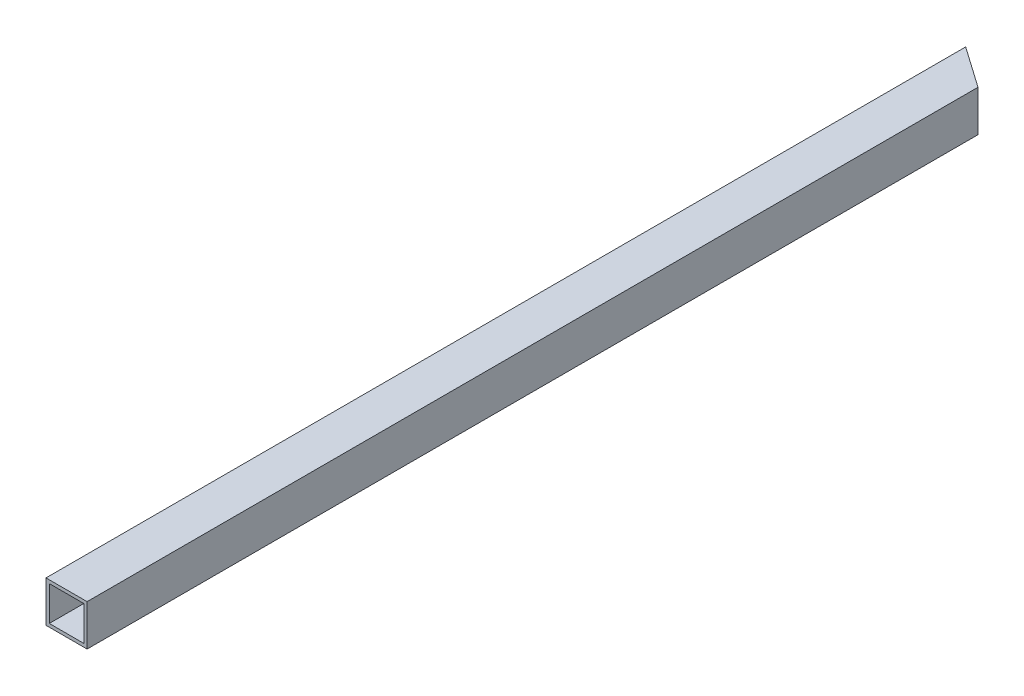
ISO-10303-21;
HEADER;
FILE_DESCRIPTION(('STEP AP214'),'2;1');
FILE_NAME('part.step','',(''),(''),'','','');
FILE_SCHEMA(('AUTOMOTIVE_DESIGN { 1 0 10303 214 1 1 1 1 }'));
ENDSEC;
DATA;
#1=APPLICATION_CONTEXT('core data for automotive mechanical design processes');
#2=APPLICATION_PROTOCOL_DEFINITION('international standard','automotive_design',2000,#1);
#3=PRODUCT_CONTEXT('',#1,'mechanical');
#4=PRODUCT('Part','Part','',(#3));
#5=PRODUCT_RELATED_PRODUCT_CATEGORY('part','',(#4));
#6=PRODUCT_DEFINITION_FORMATION('','',#4);
#7=PRODUCT_DEFINITION_CONTEXT('part definition',#1,'design');
#8=PRODUCT_DEFINITION('design','',#6,#7);
#9=PRODUCT_DEFINITION_SHAPE('','',#8);
#10=(LENGTH_UNIT() NAMED_UNIT(*) SI_UNIT(.MILLI.,.METRE.));
#11=(NAMED_UNIT(*) PLANE_ANGLE_UNIT() SI_UNIT($,.RADIAN.));
#12=(NAMED_UNIT(*) SI_UNIT($,.STERADIAN.) SOLID_ANGLE_UNIT());
#13=UNCERTAINTY_MEASURE_WITH_UNIT(LENGTH_MEASURE(1.E-05),#10,'distance_accuracy_value','');
#14=(GEOMETRIC_REPRESENTATION_CONTEXT(3) GLOBAL_UNCERTAINTY_ASSIGNED_CONTEXT((#13)) GLOBAL_UNIT_ASSIGNED_CONTEXT((#10,
#11,#12)) REPRESENTATION_CONTEXT('',''));
#15=CARTESIAN_POINT('',(0.,0.,0.));
#16=DIRECTION('',(0.,0.,1.));
#17=DIRECTION('',(1.,0.,0.));
#18=AXIS2_PLACEMENT_3D('',#15,#16,#17);
#19=CARTESIAN_POINT('',(-21.,21.,-25.));
#20=DIRECTION('',(1.,0.,0.));
#21=DIRECTION('',(0.,1.,0.));
#22=AXIS2_PLACEMENT_3D('',#19,#20,#21);
#23=PLANE('',#22);
#24=DIRECTION('',(0.,-1.,0.));
#25=VECTOR('',#24,1.);
#26=CARTESIAN_POINT('',(-21.,10.5,-14.7));
#27=LINE('',#26,#25);
#28=CARTESIAN_POINT('',(-21.,21.,-14.7));
#29=VERTEX_POINT('',#28);
#30=CARTESIAN_POINT('',(-21.,-21.,-14.7));
#31=VERTEX_POINT('',#30);
#32=EDGE_CURVE('E88',#29,#31,#27,.T.);
#33=ORIENTED_EDGE('',*,*,#32,.F.);
#34=DIRECTION('',(0.,0.,1.));
#35=VECTOR('',#34,1.);
#36=CARTESIAN_POINT('',(-21.,21.,-25.));
#37=LINE('',#36,#35);
#38=CARTESIAN_POINT('',(-21.,21.,1101.26844483));
#39=VERTEX_POINT('',#38);
#40=EDGE_CURVE('E10',#29,#39,#37,.T.);
#41=ORIENTED_EDGE('',*,*,#40,.T.);
#42=DIRECTION('',(0.,1.,0.));
#43=VECTOR('',#42,1.);
#44=CARTESIAN_POINT('',(-21.,10.5,1101.26844483));
#45=LINE('',#44,#43);
#46=CARTESIAN_POINT('',(-21.,-21.,1101.26844483));
#47=VERTEX_POINT('',#46);
#48=EDGE_CURVE('E143',#47,#39,#45,.T.);
#49=ORIENTED_EDGE('',*,*,#48,.F.);
#50=DIRECTION('',(0.,0.,1.));
#51=VECTOR('',#50,1.);
#52=CARTESIAN_POINT('',(-21.,-21.,-25.));
#53=LINE('',#52,#51);
#54=EDGE_CURVE('E163',#31,#47,#53,.T.);
#55=ORIENTED_EDGE('',*,*,#54,.F.);
#56=EDGE_LOOP('',(#33,#41,#49,#55));
#57=FACE_BOUND('',#56,.T.);
#58=ADVANCED_FACE('F16',(#57),#23,.T.);
#59=CARTESIAN_POINT('',(21.,21.,-25.));
#60=DIRECTION('',(0.,-1.,0.));
#61=DIRECTION('',(0.,0.,-1.));
#62=AXIS2_PLACEMENT_3D('',#59,#60,#61);
#63=PLANE('',#62);
#64=DIRECTION('',(-0.819231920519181,0.,-0.573462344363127));
#65=VECTOR('',#64,1.);
#66=CARTESIAN_POINT('',(1.174496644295,21.,0.822147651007));
#67=LINE('',#66,#65);
#68=CARTESIAN_POINT('',(21.,21.,14.7));
#69=VERTEX_POINT('',#68);
#70=EDGE_CURVE('E83',#69,#29,#67,.T.);
#71=ORIENTED_EDGE('',*,*,#70,.F.);
#72=DIRECTION('',(0.,0.,1.));
#73=VECTOR('',#72,1.);
#74=CARTESIAN_POINT('',(21.,21.,-25.));
#75=LINE('',#74,#73);
#76=CARTESIAN_POINT('',(21.,21.,1101.26844483));
#77=VERTEX_POINT('',#76);
#78=EDGE_CURVE('E26',#69,#77,#75,.T.);
#79=ORIENTED_EDGE('',*,*,#78,.T.);
#80=DIRECTION('',(1.,0.,0.));
#81=VECTOR('',#80,1.);
#82=CARTESIAN_POINT('',(10.5,21.,1101.26844483));
#83=LINE('',#82,#81);
#84=EDGE_CURVE('E150',#39,#77,#83,.T.);
#85=ORIENTED_EDGE('',*,*,#84,.F.);
#86=ORIENTED_EDGE('',*,*,#40,.F.);
#87=EDGE_LOOP('',(#71,#79,#85,#86));
#88=FACE_BOUND('',#87,.T.);
#89=ADVANCED_FACE('F18',(#88),#63,.T.);
#90=CARTESIAN_POINT('',(21.,-21.,-25.));
#91=DIRECTION('',(-1.,0.,0.));
#92=DIRECTION('',(0.,0.,1.));
#93=AXIS2_PLACEMENT_3D('',#90,#91,#92);
#94=PLANE('',#93);
#95=DIRECTION('',(0.,1.,0.));
#96=VECTOR('',#95,1.);
#97=CARTESIAN_POINT('',(21.,-10.5,14.7));
#98=LINE('',#97,#96);
#99=CARTESIAN_POINT('',(21.,-21.,14.7));
#100=VERTEX_POINT('',#99);
#101=EDGE_CURVE('E75',#100,#69,#98,.T.);
#102=ORIENTED_EDGE('',*,*,#101,.F.);
#103=DIRECTION('',(0.,0.,1.));
#104=VECTOR('',#103,1.);
#105=CARTESIAN_POINT('',(21.,-21.,-25.));
#106=LINE('',#105,#104);
#107=CARTESIAN_POINT('',(21.,-21.,1101.26844483));
#108=VERTEX_POINT('',#107);
#109=EDGE_CURVE('E39',#100,#108,#106,.T.);
#110=ORIENTED_EDGE('',*,*,#109,.T.);
#111=DIRECTION('',(0.,-1.,0.));
#112=VECTOR('',#111,1.);
#113=CARTESIAN_POINT('',(21.,-10.5,1101.26844483));
#114=LINE('',#113,#112);
#115=EDGE_CURVE('E77',#77,#108,#114,.T.);
#116=ORIENTED_EDGE('',*,*,#115,.F.);
#117=ORIENTED_EDGE('',*,*,#78,.F.);
#118=EDGE_LOOP('',(#102,#110,#116,#117));
#119=FACE_BOUND('',#118,.T.);
#120=ADVANCED_FACE('F73',(#119),#94,.T.);
#121=CARTESIAN_POINT('',(-21.,-21.,-25.));
#122=DIRECTION('',(0.,1.,0.));
#123=DIRECTION('',(1.,0.,0.));
#124=AXIS2_PLACEMENT_3D('',#121,#122,#123);
#125=PLANE('',#124);
#126=DIRECTION('',(0.819231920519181,0.,0.573462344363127));
#127=VECTOR('',#126,1.);
#128=CARTESIAN_POINT('',(-12.91946308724,-21.,-9.043624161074));
#129=LINE('',#128,#127);
#130=EDGE_CURVE('E94',#31,#100,#129,.T.);
#131=ORIENTED_EDGE('',*,*,#130,.F.);
#132=ORIENTED_EDGE('',*,*,#54,.T.);
#133=DIRECTION('',(-1.,0.,0.));
#134=VECTOR('',#133,1.);
#135=CARTESIAN_POINT('',(-10.5,-21.,1101.26844483));
#136=LINE('',#135,#134);
#137=EDGE_CURVE('E155',#108,#47,#136,.T.);
#138=ORIENTED_EDGE('',*,*,#137,.F.);
#139=ORIENTED_EDGE('',*,*,#109,.F.);
#140=EDGE_LOOP('',(#131,#132,#138,#139));
#141=FACE_BOUND('',#140,.T.);
#142=ADVANCED_FACE('F191',(#141),#125,.T.);
#143=CARTESIAN_POINT('',(25.,25.,-25.));
#144=DIRECTION('',(0.,-1.,0.));
#145=DIRECTION('',(0.,0.,-1.));
#146=AXIS2_PLACEMENT_3D('',#143,#144,#145);
#147=PLANE('',#146);
#148=DIRECTION('',(0.,0.,1.));
#149=VECTOR('',#148,1.);
#150=CARTESIAN_POINT('',(-25.,25.,-25.));
#151=LINE('',#150,#149);
#152=CARTESIAN_POINT('',(-25.,25.,-17.5));
#153=VERTEX_POINT('',#152);
#154=CARTESIAN_POINT('',(-25.,25.,1101.26844483));
#155=VERTEX_POINT('',#154);
#156=EDGE_CURVE('E159',#153,#155,#151,.T.);
#157=ORIENTED_EDGE('',*,*,#156,.T.);
#158=DIRECTION('',(1.,0.,0.));
#159=VECTOR('',#158,1.);
#160=CARTESIAN_POINT('',(12.5,25.,1101.26844483));
#161=LINE('',#160,#159);
#162=CARTESIAN_POINT('',(25.,25.,1101.26844483));
#163=VERTEX_POINT('',#162);
#164=EDGE_CURVE('E122',#155,#163,#161,.T.);
#165=ORIENTED_EDGE('',*,*,#164,.T.);
#166=DIRECTION('',(0.,0.,1.));
#167=VECTOR('',#166,1.);
#168=CARTESIAN_POINT('',(25.,25.,-25.));
#169=LINE('',#168,#167);
#170=CARTESIAN_POINT('',(25.,25.,17.5));
#171=VERTEX_POINT('',#170);
#172=EDGE_CURVE('E137',#171,#163,#169,.T.);
#173=ORIENTED_EDGE('',*,*,#172,.F.);
#174=DIRECTION('',(-0.819231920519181,0.,-0.573462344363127));
#175=VECTOR('',#174,1.);
#176=CARTESIAN_POINT('',(2.51677852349,25.,1.761744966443));
#177=LINE('',#176,#175);
#178=EDGE_CURVE('E121',#171,#153,#177,.T.);
#179=ORIENTED_EDGE('',*,*,#178,.T.);
#180=EDGE_LOOP('',(#157,#165,#173,#179));
#181=FACE_BOUND('',#180,.T.);
#182=ADVANCED_FACE('F185',(#181),#147,.F.);
#183=CARTESIAN_POINT('',(-25.,25.,-25.));
#184=DIRECTION('',(1.,0.,0.));
#185=DIRECTION('',(0.,1.,0.));
#186=AXIS2_PLACEMENT_3D('',#183,#184,#185);
#187=PLANE('',#186);
#188=DIRECTION('',(0.,0.,1.));
#189=VECTOR('',#188,1.);
#190=CARTESIAN_POINT('',(-25.,-25.,-25.));
#191=LINE('',#190,#189);
#192=CARTESIAN_POINT('',(-25.,-25.,-17.5));
#193=VERTEX_POINT('',#192);
#194=CARTESIAN_POINT('',(-25.,-25.,1101.26844483));
#195=VERTEX_POINT('',#194);
#196=EDGE_CURVE('E111',#193,#195,#191,.T.);
#197=ORIENTED_EDGE('',*,*,#196,.T.);
#198=DIRECTION('',(0.,1.,0.));
#199=VECTOR('',#198,1.);
#200=CARTESIAN_POINT('',(-25.,12.5,1101.26844483));
#201=LINE('',#200,#199);
#202=EDGE_CURVE('E126',#195,#155,#201,.T.);
#203=ORIENTED_EDGE('',*,*,#202,.T.);
#204=ORIENTED_EDGE('',*,*,#156,.F.);
#205=DIRECTION('',(0.,-1.,0.));
#206=VECTOR('',#205,1.);
#207=CARTESIAN_POINT('',(-25.,12.5,-17.5));
#208=LINE('',#207,#206);
#209=EDGE_CURVE('E96',#153,#193,#208,.T.);
#210=ORIENTED_EDGE('',*,*,#209,.T.);
#211=EDGE_LOOP('',(#197,#203,#204,#210));
#212=FACE_BOUND('',#211,.T.);
#213=ADVANCED_FACE('F190',(#212),#187,.F.);
#214=CARTESIAN_POINT('',(0.,0.,1101.26844483));
#215=DIRECTION('',(0.,0.,-1.));
#216=DIRECTION('',(0.,-1.,0.));
#217=AXIS2_PLACEMENT_3D('',#214,#215,#216);
#218=PLANE('',#217);
#219=ORIENTED_EDGE('',*,*,#48,.T.);
#220=ORIENTED_EDGE('',*,*,#84,.T.);
#221=ORIENTED_EDGE('',*,*,#115,.T.);
#222=ORIENTED_EDGE('',*,*,#137,.T.);
#223=EDGE_LOOP('',(#219,#220,#221,#222));
#224=FACE_BOUND('',#223,.T.);
#225=ORIENTED_EDGE('',*,*,#164,.F.);
#226=ORIENTED_EDGE('',*,*,#202,.F.);
#227=DIRECTION('',(-1.,0.,0.));
#228=VECTOR('',#227,1.);
#229=CARTESIAN_POINT('',(-12.5,-25.,1101.26844483));
#230=LINE('',#229,#228);
#231=CARTESIAN_POINT('',(25.,-25.,1101.26844483));
#232=VERTEX_POINT('',#231);
#233=EDGE_CURVE('E108',#232,#195,#230,.T.);
#234=ORIENTED_EDGE('',*,*,#233,.F.);
#235=DIRECTION('',(0.,-1.,0.));
#236=VECTOR('',#235,1.);
#237=CARTESIAN_POINT('',(25.,-12.5,1101.26844483));
#238=LINE('',#237,#236);
#239=EDGE_CURVE('E127',#163,#232,#238,.T.);
#240=ORIENTED_EDGE('',*,*,#239,.F.);
#241=EDGE_LOOP('',(#225,#226,#234,#240));
#242=FACE_BOUND('',#241,.T.);
#243=ADVANCED_FACE('F209',(#224,#242),#218,.F.);
#244=CARTESIAN_POINT('',(25.,-25.,-25.));
#245=DIRECTION('',(-1.,0.,0.));
#246=DIRECTION('',(0.,0.,1.));
#247=AXIS2_PLACEMENT_3D('',#244,#245,#246);
#248=PLANE('',#247);
#249=ORIENTED_EDGE('',*,*,#172,.T.);
#250=ORIENTED_EDGE('',*,*,#239,.T.);
#251=DIRECTION('',(0.,0.,1.));
#252=VECTOR('',#251,1.);
#253=CARTESIAN_POINT('',(25.,-25.,-25.));
#254=LINE('',#253,#252);
#255=CARTESIAN_POINT('',(25.,-25.,17.5));
#256=VERTEX_POINT('',#255);
#257=EDGE_CURVE('E107',#256,#232,#254,.T.);
#258=ORIENTED_EDGE('',*,*,#257,.F.);
#259=DIRECTION('',(0.,1.,0.));
#260=VECTOR('',#259,1.);
#261=CARTESIAN_POINT('',(25.,-12.5,17.5));
#262=LINE('',#261,#260);
#263=EDGE_CURVE('E103',#256,#171,#262,.T.);
#264=ORIENTED_EDGE('',*,*,#263,.T.);
#265=EDGE_LOOP('',(#249,#250,#258,#264));
#266=FACE_BOUND('',#265,.T.);
#267=ADVANCED_FACE('F201',(#266),#248,.F.);
#268=CARTESIAN_POINT('',(0.,0.,0.));
#269=DIRECTION('',(-0.573462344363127,0.,0.819231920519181));
#270=DIRECTION('',(0.,1.,0.));
#271=AXIS2_PLACEMENT_3D('',#268,#269,#270);
#272=PLANE('',#271);
#273=ORIENTED_EDGE('',*,*,#101,.T.);
#274=ORIENTED_EDGE('',*,*,#70,.T.);
#275=ORIENTED_EDGE('',*,*,#32,.T.);
#276=ORIENTED_EDGE('',*,*,#130,.T.);
#277=EDGE_LOOP('',(#273,#274,#275,#276));
#278=FACE_BOUND('',#277,.T.);
#279=ORIENTED_EDGE('',*,*,#178,.F.);
#280=ORIENTED_EDGE('',*,*,#263,.F.);
#281=DIRECTION('',(0.819231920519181,0.,0.573462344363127));
#282=VECTOR('',#281,1.);
#283=CARTESIAN_POINT('',(-14.26174496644,-25.,-9.98322147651));
#284=LINE('',#283,#282);
#285=EDGE_CURVE('E117',#193,#256,#284,.T.);
#286=ORIENTED_EDGE('',*,*,#285,.F.);
#287=ORIENTED_EDGE('',*,*,#209,.F.);
#288=EDGE_LOOP('',(#279,#280,#286,#287));
#289=FACE_BOUND('',#288,.T.);
#290=ADVANCED_FACE('F91',(#278,#289),#272,.F.);
#291=CARTESIAN_POINT('',(-25.,-25.,-25.));
#292=DIRECTION('',(0.,1.,0.));
#293=DIRECTION('',(1.,0.,0.));
#294=AXIS2_PLACEMENT_3D('',#291,#292,#293);
#295=PLANE('',#294);
#296=ORIENTED_EDGE('',*,*,#257,.T.);
#297=ORIENTED_EDGE('',*,*,#233,.T.);
#298=ORIENTED_EDGE('',*,*,#196,.F.);
#299=ORIENTED_EDGE('',*,*,#285,.T.);
#300=EDGE_LOOP('',(#296,#297,#298,#299));
#301=FACE_BOUND('',#300,.T.);
#302=ADVANCED_FACE('F174',(#301),#295,.F.);
#303=CLOSED_SHELL('',(#58,#89,#120,#142,#182,#213,#243,#267,#290,#302));
#304=MANIFOLD_SOLID_BREP('B1',#303);
#305=ADVANCED_BREP_SHAPE_REPRESENTATION('',(#18,#304),#14);
#306=SHAPE_DEFINITION_REPRESENTATION(#9,#305);
ENDSEC;
END-ISO-10303-21;
